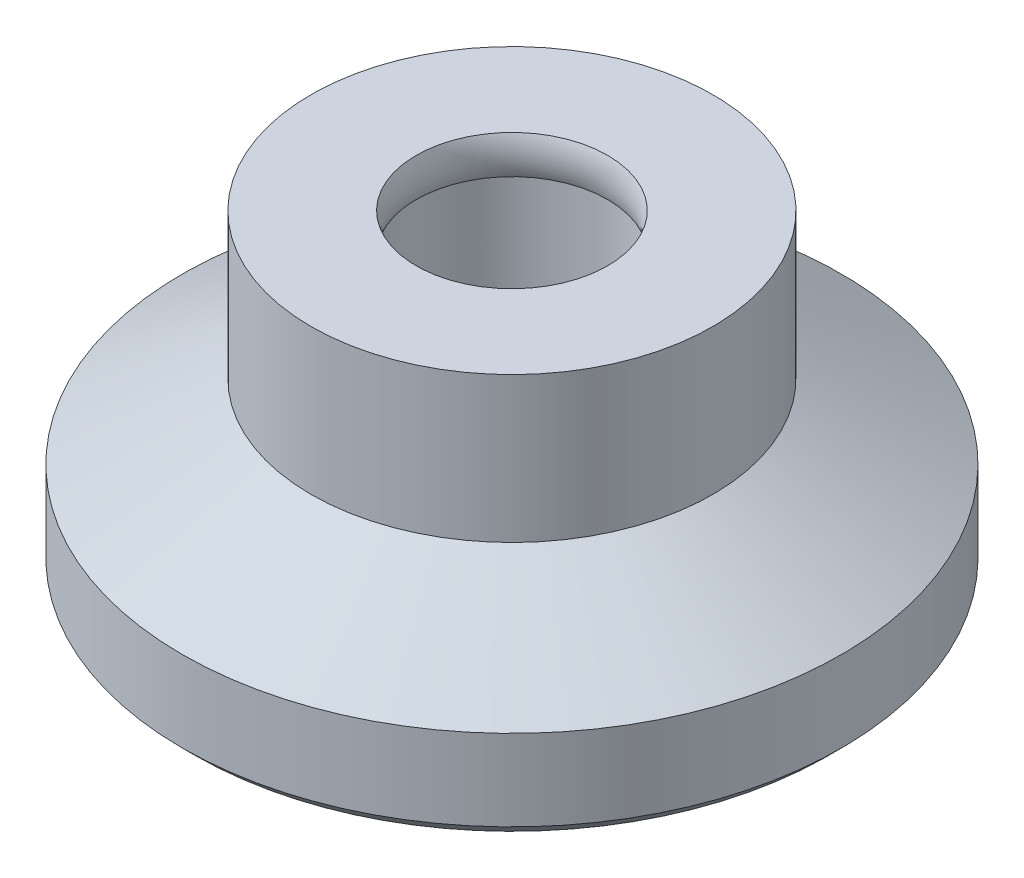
ISO-10303-21;
HEADER;
FILE_DESCRIPTION(('STEP AP214'),'2;1');
FILE_NAME('part.step','',(''),(''),'','','');
FILE_SCHEMA(('AUTOMOTIVE_DESIGN { 1 0 10303 214 1 1 1 1 }'));
ENDSEC;
DATA;
#1=APPLICATION_CONTEXT('core data for automotive mechanical design processes');
#2=APPLICATION_PROTOCOL_DEFINITION('international standard','automotive_design',2000,#1);
#3=PRODUCT_CONTEXT('',#1,'mechanical');
#4=PRODUCT('Part','Part','',(#3));
#5=PRODUCT_RELATED_PRODUCT_CATEGORY('part','',(#4));
#6=PRODUCT_DEFINITION_FORMATION('','',#4);
#7=PRODUCT_DEFINITION_CONTEXT('part definition',#1,'design');
#8=PRODUCT_DEFINITION('design','',#6,#7);
#9=PRODUCT_DEFINITION_SHAPE('','',#8);
#10=(LENGTH_UNIT() NAMED_UNIT(*) SI_UNIT(.MILLI.,.METRE.));
#11=(NAMED_UNIT(*) PLANE_ANGLE_UNIT() SI_UNIT($,.RADIAN.));
#12=(NAMED_UNIT(*) SI_UNIT($,.STERADIAN.) SOLID_ANGLE_UNIT());
#13=UNCERTAINTY_MEASURE_WITH_UNIT(LENGTH_MEASURE(1.E-05),#10,'distance_accuracy_value','');
#14=(GEOMETRIC_REPRESENTATION_CONTEXT(3) GLOBAL_UNCERTAINTY_ASSIGNED_CONTEXT((#13)) GLOBAL_UNIT_ASSIGNED_CONTEXT((#10,
#11,#12)) REPRESENTATION_CONTEXT('',''));
#15=CARTESIAN_POINT('',(0.,0.,0.));
#16=DIRECTION('',(0.,0.,1.));
#17=DIRECTION('',(1.,0.,0.));
#18=AXIS2_PLACEMENT_3D('',#15,#16,#17);
#19=CARTESIAN_POINT('',(0.,5.,0.));
#20=DIRECTION('',(0.,-1.,0.));
#21=DIRECTION('',(0.,0.,-1.));
#22=AXIS2_PLACEMENT_3D('',#19,#20,#21);
#23=CYLINDRICAL_SURFACE('',#22,6.4);
#24=CARTESIAN_POINT('',(0.,0.367136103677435,0.));
#25=DIRECTION('',(0.,1.,0.));
#26=DIRECTION('',(0.,0.,1.));
#27=AXIS2_PLACEMENT_3D('',#24,#25,#26);
#28=CIRCLE('',#27,6.4);
#29=CARTESIAN_POINT('',(0.,0.367136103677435,6.4));
#30=VERTEX_POINT('',#29);
#31=EDGE_CURVE('E91',#30,#30,#28,.T.);
#32=ORIENTED_EDGE('',*,*,#31,.T.);
#33=EDGE_LOOP('',(#32));
#34=FACE_BOUND('',#33,.T.);
#35=CARTESIAN_POINT('',(0.,5.,0.));
#36=DIRECTION('',(0.,1.,0.));
#37=DIRECTION('',(0.,0.,1.));
#38=AXIS2_PLACEMENT_3D('',#35,#36,#37);
#39=CIRCLE('',#38,6.4);
#40=CARTESIAN_POINT('',(0.,5.,6.4));
#41=VERTEX_POINT('',#40);
#42=EDGE_CURVE('E93',#41,#41,#39,.T.);
#43=ORIENTED_EDGE('',*,*,#42,.F.);
#44=EDGE_LOOP('',(#43));
#45=FACE_BOUND('',#44,.T.);
#46=ADVANCED_FACE('F37',(#34,#45),#23,.T.);
#47=CARTESIAN_POINT('',(0.,5.,0.));
#48=DIRECTION('',(0.,1.,0.));
#49=DIRECTION('',(0.,0.,1.));
#50=AXIS2_PLACEMENT_3D('',#47,#48,#49);
#51=PLANE('',#50);
#52=CARTESIAN_POINT('',(0.,5.,0.));
#53=DIRECTION('',(0.,-1.,0.));
#54=DIRECTION('',(0.,0.,-1.));
#55=AXIS2_PLACEMENT_3D('',#52,#53,#54);
#56=CIRCLE('',#55,3.05);
#57=CARTESIAN_POINT('',(0.,5.,-3.05));
#58=VERTEX_POINT('',#57);
#59=EDGE_CURVE('E108',#58,#58,#56,.T.);
#60=ORIENTED_EDGE('',*,*,#59,.T.);
#61=EDGE_LOOP('',(#60));
#62=FACE_BOUND('',#61,.T.);
#63=ORIENTED_EDGE('',*,*,#42,.T.);
#64=EDGE_LOOP('',(#63));
#65=FACE_BOUND('',#64,.T.);
#66=ADVANCED_FACE('F65',(#62,#65),#51,.T.);
#67=CARTESIAN_POINT('',(0.,0.367136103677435,0.));
#68=DIRECTION('',(0.,-1.,0.));
#69=DIRECTION('',(0.,0.,-1.));
#70=AXIS2_PLACEMENT_3D('',#67,#68,#69);
#71=CONICAL_SURFACE('',#70,6.4,1.0471975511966);
#72=CARTESIAN_POINT('',(0.,-2.,0.));
#73=DIRECTION('',(0.,1.,0.));
#74=DIRECTION('',(0.,0.,1.));
#75=AXIS2_PLACEMENT_3D('',#72,#73,#74);
#76=CIRCLE('',#75,10.5);
#77=CARTESIAN_POINT('',(0.,-2.,10.5));
#78=VERTEX_POINT('',#77);
#79=EDGE_CURVE('E89',#78,#78,#76,.T.);
#80=ORIENTED_EDGE('',*,*,#79,.T.);
#81=EDGE_LOOP('',(#80));
#82=FACE_BOUND('',#81,.T.);
#83=ORIENTED_EDGE('',*,*,#31,.F.);
#84=EDGE_LOOP('',(#83));
#85=FACE_BOUND('',#84,.T.);
#86=ADVANCED_FACE('F70',(#82,#85),#71,.T.);
#87=CARTESIAN_POINT('',(0.,-5.,0.));
#88=DIRECTION('',(0.,1.,0.));
#89=DIRECTION('',(0.,0.,1.));
#90=AXIS2_PLACEMENT_3D('',#87,#88,#89);
#91=PLANE('',#90);
#92=CARTESIAN_POINT('',(0.,-5.,0.));
#93=DIRECTION('',(0.,1.,0.));
#94=DIRECTION('',(0.,0.,1.));
#95=AXIS2_PLACEMENT_3D('',#92,#93,#94);
#96=CIRCLE('',#95,10.08);
#97=CARTESIAN_POINT('',(0.,-5.,10.08));
#98=VERTEX_POINT('',#97);
#99=EDGE_CURVE('E45',#98,#98,#96,.F.);
#100=ORIENTED_EDGE('',*,*,#99,.T.);
#101=EDGE_LOOP('',(#100));
#102=FACE_BOUND('',#101,.T.);
#103=ADVANCED_FACE('F76',(#102),#91,.F.);
#104=CARTESIAN_POINT('',(0.,-2.,0.));
#105=DIRECTION('',(0.,-1.,0.));
#106=DIRECTION('',(0.,0.,-1.));
#107=AXIS2_PLACEMENT_3D('',#104,#105,#106);
#108=CYLINDRICAL_SURFACE('',#107,10.5);
#109=CARTESIAN_POINT('',(0.,-4.57999999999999,0.));
#110=DIRECTION('',(0.,1.,0.));
#111=DIRECTION('',(0.,0.,1.));
#112=AXIS2_PLACEMENT_3D('',#109,#110,#111);
#113=CIRCLE('',#112,10.5);
#114=CARTESIAN_POINT('',(0.,-4.57999999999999,10.5));
#115=VERTEX_POINT('',#114);
#116=EDGE_CURVE('E11',#115,#115,#113,.T.);
#117=ORIENTED_EDGE('',*,*,#116,.T.);
#118=EDGE_LOOP('',(#117));
#119=FACE_BOUND('',#118,.T.);
#120=ORIENTED_EDGE('',*,*,#79,.F.);
#121=EDGE_LOOP('',(#120));
#122=FACE_BOUND('',#121,.T.);
#123=ADVANCED_FACE('F60',(#119,#122),#108,.T.);
#124=CARTESIAN_POINT('',(0.,-5.,0.));
#125=DIRECTION('',(0.,1.,0.));
#126=DIRECTION('',(0.,0.,1.));
#127=AXIS2_PLACEMENT_3D('',#124,#125,#126);
#128=CONICAL_SURFACE('',#127,10.08,0.785398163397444);
#129=CARTESIAN_POINT('',(0.,-4.57999999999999,10.5));
#130=CARTESIAN_POINT('',(0.,-4.58437499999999,10.495625));
#131=CARTESIAN_POINT('',(0.,-4.58874999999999,10.49125));
#132=CARTESIAN_POINT('',(0.,-4.59749999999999,10.4825));
#133=CARTESIAN_POINT('',(0.,-4.60187499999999,10.478125));
#134=CARTESIAN_POINT('',(0.,-4.61062499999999,10.469375));
#135=CARTESIAN_POINT('',(0.,-4.61499999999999,10.465));
#136=CARTESIAN_POINT('',(0.,-4.62374999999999,10.45625));
#137=CARTESIAN_POINT('',(0.,-4.62812499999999,10.451875));
#138=CARTESIAN_POINT('',(0.,-4.63687499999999,10.443125));
#139=CARTESIAN_POINT('',(0.,-4.64124999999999,10.43875));
#140=CARTESIAN_POINT('',(0.,-4.64999999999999,10.43));
#141=CARTESIAN_POINT('',(0.,-4.65437499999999,10.425625));
#142=CARTESIAN_POINT('',(0.,-4.66312499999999,10.416875));
#143=CARTESIAN_POINT('',(0.,-4.66749999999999,10.4125));
#144=CARTESIAN_POINT('',(0.,-4.67624999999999,10.40375));
#145=CARTESIAN_POINT('',(0.,-4.68062499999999,10.399375));
#146=CARTESIAN_POINT('',(0.,-4.68937499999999,10.390625));
#147=CARTESIAN_POINT('',(0.,-4.69374999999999,10.38625));
#148=CARTESIAN_POINT('',(0.,-4.70249999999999,10.3775));
#149=CARTESIAN_POINT('',(0.,-4.70687499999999,10.373125));
#150=CARTESIAN_POINT('',(0.,-4.71562499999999,10.364375));
#151=CARTESIAN_POINT('',(0.,-4.72,10.36));
#152=CARTESIAN_POINT('',(0.,-4.72875,10.35125));
#153=CARTESIAN_POINT('',(0.,-4.73312499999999,10.346875));
#154=CARTESIAN_POINT('',(0.,-4.74187499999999,10.338125));
#155=CARTESIAN_POINT('',(0.,-4.74625,10.33375));
#156=CARTESIAN_POINT('',(0.,-4.755,10.325));
#157=CARTESIAN_POINT('',(0.,-4.759375,10.320625));
#158=CARTESIAN_POINT('',(0.,-4.768125,10.311875));
#159=CARTESIAN_POINT('',(0.,-4.7725,10.3075));
#160=CARTESIAN_POINT('',(0.,-4.78125,10.29875));
#161=CARTESIAN_POINT('',(0.,-4.785625,10.294375));
#162=CARTESIAN_POINT('',(0.,-4.794375,10.285625));
#163=CARTESIAN_POINT('',(0.,-4.79875,10.28125));
#164=CARTESIAN_POINT('',(0.,-4.8075,10.2725));
#165=CARTESIAN_POINT('',(0.,-4.811875,10.268125));
#166=CARTESIAN_POINT('',(0.,-4.820625,10.259375));
#167=CARTESIAN_POINT('',(0.,-4.825,10.255));
#168=CARTESIAN_POINT('',(0.,-4.83375,10.24625));
#169=CARTESIAN_POINT('',(0.,-4.838125,10.241875));
#170=CARTESIAN_POINT('',(0.,-4.846875,10.233125));
#171=CARTESIAN_POINT('',(0.,-4.85125,10.22875));
#172=CARTESIAN_POINT('',(0.,-4.86,10.22));
#173=CARTESIAN_POINT('',(0.,-4.864375,10.215625));
#174=CARTESIAN_POINT('',(0.,-4.873125,10.206875));
#175=CARTESIAN_POINT('',(0.,-4.8775,10.2025));
#176=CARTESIAN_POINT('',(0.,-4.88625,10.19375));
#177=CARTESIAN_POINT('',(0.,-4.890625,10.189375));
#178=CARTESIAN_POINT('',(0.,-4.899375,10.180625));
#179=CARTESIAN_POINT('',(0.,-4.90375,10.17625));
#180=CARTESIAN_POINT('',(0.,-4.9125,10.1675));
#181=CARTESIAN_POINT('',(0.,-4.916875,10.163125));
#182=CARTESIAN_POINT('',(0.,-4.925625,10.154375));
#183=CARTESIAN_POINT('',(0.,-4.93,10.15));
#184=CARTESIAN_POINT('',(0.,-4.93875,10.14125));
#185=CARTESIAN_POINT('',(0.,-4.943125,10.136875));
#186=CARTESIAN_POINT('',(0.,-4.951875,10.128125));
#187=CARTESIAN_POINT('',(0.,-4.95625,10.12375));
#188=CARTESIAN_POINT('',(0.,-4.965,10.115));
#189=CARTESIAN_POINT('',(0.,-4.969375,10.110625));
#190=CARTESIAN_POINT('',(0.,-4.978125,10.101875));
#191=CARTESIAN_POINT('',(0.,-4.9825,10.0975));
#192=CARTESIAN_POINT('',(0.,-4.99125,10.08875));
#193=CARTESIAN_POINT('',(0.,-4.995625,10.084375));
#194=CARTESIAN_POINT('',(0.,-5.,10.08));
#195=B_SPLINE_CURVE_WITH_KNOTS('',3,(#129,#130,#131,#132,#133,#134,#135,#136,#137,#138,#139,
#140,#141,#142,#143,#144,#145,#146,#147,#148,#149,#150,#151,#152,#153,#154,#155,#156,#157,#158,
#159,#160,#161,#162,#163,#164,#165,#166,#167,#168,#169,#170,#171,#172,#173,#174,#175,#176,#177,
#178,#179,#180,#181,#182,#183,#184,#185,#186,#187,#188,#189,#190,#191,#192,#193,#194),
.UNSPECIFIED.,.F.,.F.,(4,2,2,2,2,2,2,2,2,2,2,2,2,2,2,2,2,2,2,2,2,2,2,2,2,2,2,2,2,2,2,2,4),(0.,
0.0185615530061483,0.0371231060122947,0.0556846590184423,0.0742462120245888,0.0928077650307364,
0.111369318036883,0.129930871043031,0.148492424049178,0.167053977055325,0.185615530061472,
0.20417708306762,0.222738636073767,0.241300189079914,0.259861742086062,0.278423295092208,
0.296984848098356,0.315546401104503,0.33410795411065,0.352669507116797,0.371231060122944,
0.389792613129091,0.408354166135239,0.426915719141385,0.445477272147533,0.464038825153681,
0.482600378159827,0.501161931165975,0.519723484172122,0.53828503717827,0.556846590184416,
0.575408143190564,0.59396969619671),.UNSPECIFIED.);
#196=EDGE_CURVE('BSEAM39',#115,#98,#195,.T.);
#197=ORIENTED_EDGE('',*,*,#116,.F.);
#198=ORIENTED_EDGE('',*,*,#99,.F.);
#199=ORIENTED_EDGE('',*,*,#196,.T.);
#200=ORIENTED_EDGE('',*,*,#196,.F.);
#201=EDGE_LOOP('',(#197,#199,#198,#200));
#202=FACE_BOUND('',#201,.T.);
#203=ADVANCED_FACE('F39',(#202),#128,.T.);
#204=CARTESIAN_POINT('',(0.,-2.,0.));
#205=DIRECTION('',(0.,1.,0.));
#206=DIRECTION('',(0.,0.,1.));
#207=AXIS2_PLACEMENT_3D('',#204,#205,#206);
#208=CONICAL_SURFACE('',#207,0.,1.04719755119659);
#209=CARTESIAN_POINT('',(0.,-0.239081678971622,0.));
#210=DIRECTION('',(0.,-1.,0.));
#211=DIRECTION('',(0.,0.,-1.));
#212=AXIS2_PLACEMENT_3D('',#209,#210,#211);
#213=CIRCLE('',#212,3.05);
#214=CARTESIAN_POINT('',(0.,-0.239081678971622,-3.05));
#215=VERTEX_POINT('',#214);
#216=EDGE_CURVE('E100',#215,#215,#213,.T.);
#217=ORIENTED_EDGE('',*,*,#216,.F.);
#218=EDGE_LOOP('',(#217));
#219=FACE_BOUND('',#218,.T.);
#220=CARTESIAN_POINT('',(0.,-2.,0.));
#221=VERTEX_POINT('',#220);
#222=VERTEX_LOOP('',#221);
#223=FACE_BOUND('',#222,.T.);
#224=ADVANCED_FACE('F48',(#219,#223),#208,.F.);
#225=CARTESIAN_POINT('',(0.,0.,0.));
#226=DIRECTION('',(0.,-1.,0.));
#227=DIRECTION('',(0.,0.,-1.));
#228=AXIS2_PLACEMENT_3D('',#225,#226,#227);
#229=CYLINDRICAL_SURFACE('',#228,3.05);
#230=CARTESIAN_POINT('',(0.,3.78,0.));
#231=DIRECTION('',(0.,-1.,0.));
#232=DIRECTION('',(0.,0.,-1.));
#233=AXIS2_PLACEMENT_3D('',#230,#231,#232);
#234=CIRCLE('',#233,3.05);
#235=CARTESIAN_POINT('',(0.,3.78,-3.05));
#236=VERTEX_POINT('',#235);
#237=EDGE_CURVE('E111',#236,#236,#234,.T.);
#238=ORIENTED_EDGE('',*,*,#237,.F.);
#239=EDGE_LOOP('',(#238));
#240=FACE_BOUND('',#239,.T.);
#241=ORIENTED_EDGE('',*,*,#216,.T.);
#242=EDGE_LOOP('',(#241));
#243=FACE_BOUND('',#242,.T.);
#244=ADVANCED_FACE('F50',(#240,#243),#229,.F.);
#245=CARTESIAN_POINT('',(0.,4.39,0.));
#246=DIRECTION('',(0.,-1.,0.));
#247=DIRECTION('',(0.,0.,-1.));
#248=AXIS2_PLACEMENT_3D('',#245,#246,#247);
#249=TOROIDAL_SURFACE('',#248,4.51399999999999,1.58599999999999);
#250=ORIENTED_EDGE('',*,*,#59,.F.);
#251=EDGE_LOOP('',(#250));
#252=FACE_BOUND('',#251,.T.);
#253=ORIENTED_EDGE('',*,*,#237,.T.);
#254=EDGE_LOOP('',(#253));
#255=FACE_BOUND('',#254,.T.);
#256=ADVANCED_FACE('F57',(#252,#255),#249,.T.);
#257=CLOSED_SHELL('',(#46,#66,#86,#103,#123,#203,#224,#244,#256));
#258=MANIFOLD_SOLID_BREP('B2',#257);
#259=ADVANCED_BREP_SHAPE_REPRESENTATION('',(#18,#258),#14);
#260=SHAPE_DEFINITION_REPRESENTATION(#9,#259);
ENDSEC;
END-ISO-10303-21;
